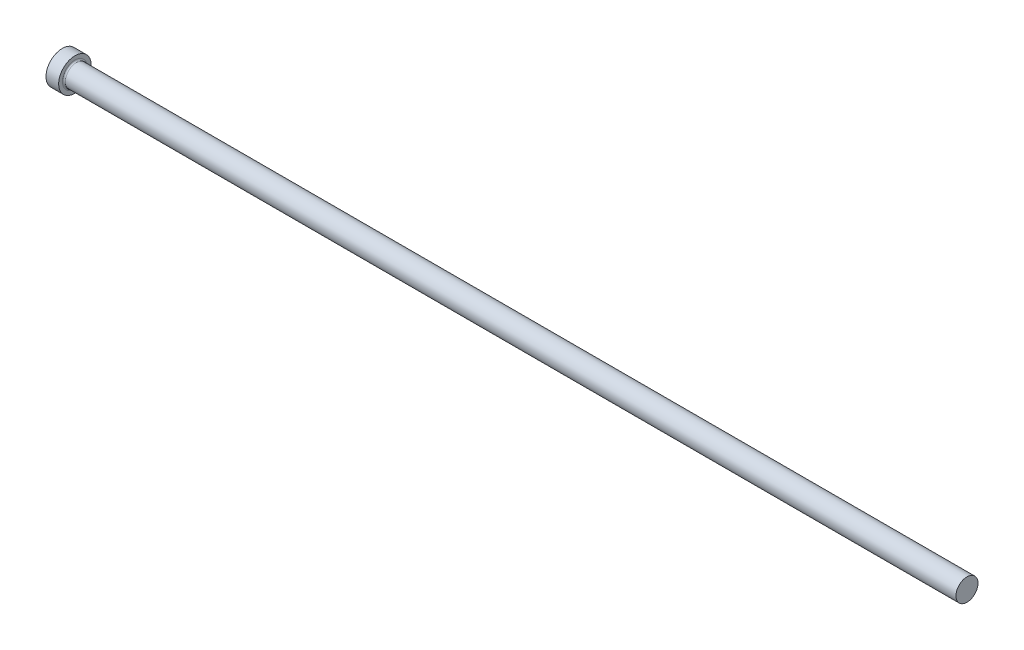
ISO-10303-21;
HEADER;
FILE_DESCRIPTION(('STEP AP214'),'2;1');
FILE_NAME('part.step','',(''),(''),'','','');
FILE_SCHEMA(('AUTOMOTIVE_DESIGN { 1 0 10303 214 1 1 1 1 }'));
ENDSEC;
DATA;
#1=APPLICATION_CONTEXT('core data for automotive mechanical design processes');
#2=APPLICATION_PROTOCOL_DEFINITION('international standard','automotive_design',2000,#1);
#3=PRODUCT_CONTEXT('',#1,'mechanical');
#4=PRODUCT('Part','Part','',(#3));
#5=PRODUCT_RELATED_PRODUCT_CATEGORY('part','',(#4));
#6=PRODUCT_DEFINITION_FORMATION('','',#4);
#7=PRODUCT_DEFINITION_CONTEXT('part definition',#1,'design');
#8=PRODUCT_DEFINITION('design','',#6,#7);
#9=PRODUCT_DEFINITION_SHAPE('','',#8);
#10=(LENGTH_UNIT() NAMED_UNIT(*) SI_UNIT(.MILLI.,.METRE.));
#11=(NAMED_UNIT(*) PLANE_ANGLE_UNIT() SI_UNIT($,.RADIAN.));
#12=(NAMED_UNIT(*) SI_UNIT($,.STERADIAN.) SOLID_ANGLE_UNIT());
#13=UNCERTAINTY_MEASURE_WITH_UNIT(LENGTH_MEASURE(1.E-05),#10,'distance_accuracy_value','');
#14=(GEOMETRIC_REPRESENTATION_CONTEXT(3) GLOBAL_UNCERTAINTY_ASSIGNED_CONTEXT((#13)) GLOBAL_UNIT_ASSIGNED_CONTEXT((#10,
#11,#12)) REPRESENTATION_CONTEXT('',''));
#15=CARTESIAN_POINT('',(0.,0.,0.));
#16=DIRECTION('',(0.,0.,1.));
#17=DIRECTION('',(1.,0.,0.));
#18=AXIS2_PLACEMENT_3D('',#15,#16,#17);
#19=CARTESIAN_POINT('',(0.,0.,0.));
#20=DIRECTION('',(-1.,0.,0.));
#21=DIRECTION('',(0.,-1.,0.));
#22=AXIS2_PLACEMENT_3D('',#19,#20,#21);
#23=PLANE('',#22);
#24=CARTESIAN_POINT('',(0.,0.,0.));
#25=DIRECTION('',(1.,0.,0.));
#26=DIRECTION('',(0.,1.,0.));
#27=AXIS2_PLACEMENT_3D('',#24,#25,#26);
#28=CIRCLE('',#27,9.);
#29=CARTESIAN_POINT('',(0.,9.,0.));
#30=VERTEX_POINT('',#29);
#31=EDGE_CURVE('E29',#30,#30,#28,.T.);
#32=ORIENTED_EDGE('',*,*,#31,.F.);
#33=EDGE_LOOP('',(#32));
#34=FACE_BOUND('',#33,.T.);
#35=ADVANCED_FACE('F14',(#34),#23,.T.);
#36=CARTESIAN_POINT('',(500.,0.,0.));
#37=DIRECTION('',(1.,0.,0.));
#38=DIRECTION('',(0.,1.,0.));
#39=AXIS2_PLACEMENT_3D('',#36,#37,#38);
#40=CYLINDRICAL_SURFACE('',#39,9.);
#41=ORIENTED_EDGE('',*,*,#31,.T.);
#42=EDGE_LOOP('',(#41));
#43=FACE_BOUND('',#42,.T.);
#44=CARTESIAN_POINT('',(7.,0.,0.));
#45=DIRECTION('',(1.,0.,0.));
#46=DIRECTION('',(0.,1.,0.));
#47=AXIS2_PLACEMENT_3D('',#44,#45,#46);
#48=CIRCLE('',#47,9.);
#49=CARTESIAN_POINT('',(7.,9.,0.));
#50=VERTEX_POINT('',#49);
#51=EDGE_CURVE('E34',#50,#50,#48,.T.);
#52=ORIENTED_EDGE('',*,*,#51,.F.);
#53=EDGE_LOOP('',(#52));
#54=FACE_BOUND('',#53,.T.);
#55=ADVANCED_FACE('F55',(#43,#54),#40,.T.);
#56=CARTESIAN_POINT('',(7.,9.,0.));
#57=DIRECTION('',(1.,0.,0.));
#58=DIRECTION('',(0.,1.,0.));
#59=AXIS2_PLACEMENT_3D('',#56,#57,#58);
#60=PLANE('',#59);
#61=CARTESIAN_POINT('',(7.,0.,0.));
#62=DIRECTION('',(1.,0.,0.));
#63=DIRECTION('',(0.,1.,0.));
#64=AXIS2_PLACEMENT_3D('',#61,#62,#63);
#65=CIRCLE('',#64,6.9);
#66=CARTESIAN_POINT('',(7.,6.9,0.));
#67=VERTEX_POINT('',#66);
#68=EDGE_CURVE('E9',#67,#67,#65,.F.);
#69=ORIENTED_EDGE('',*,*,#68,.T.);
#70=EDGE_LOOP('',(#69));
#71=FACE_BOUND('',#70,.T.);
#72=ORIENTED_EDGE('',*,*,#51,.T.);
#73=EDGE_LOOP('',(#72));
#74=FACE_BOUND('',#73,.T.);
#75=ADVANCED_FACE('F48',(#71,#74),#60,.T.);
#76=CARTESIAN_POINT('',(500.,0.,0.));
#77=DIRECTION('',(1.,0.,0.));
#78=DIRECTION('',(0.,1.,0.));
#79=AXIS2_PLACEMENT_3D('',#76,#77,#78);
#80=CYLINDRICAL_SURFACE('',#79,6.09999999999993);
#81=CARTESIAN_POINT('',(7.8,0.,0.));
#82=DIRECTION('',(1.,0.,0.));
#83=DIRECTION('',(0.,1.,0.));
#84=AXIS2_PLACEMENT_3D('',#81,#82,#83);
#85=CIRCLE('',#84,6.09999999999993);
#86=CARTESIAN_POINT('',(7.8,6.09999999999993,0.));
#87=VERTEX_POINT('',#86);
#88=EDGE_CURVE('E22',#87,#87,#85,.T.);
#89=ORIENTED_EDGE('',*,*,#88,.T.);
#90=EDGE_LOOP('',(#89));
#91=FACE_BOUND('',#90,.T.);
#92=CARTESIAN_POINT('',(500.,0.,0.));
#93=DIRECTION('',(1.,0.,0.));
#94=DIRECTION('',(0.,1.,0.));
#95=AXIS2_PLACEMENT_3D('',#92,#93,#94);
#96=CIRCLE('',#95,6.1);
#97=CARTESIAN_POINT('',(500.,6.10000000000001,0.));
#98=VERTEX_POINT('',#97);
#99=EDGE_CURVE('E39',#98,#98,#96,.T.);
#100=ORIENTED_EDGE('',*,*,#99,.F.);
#101=EDGE_LOOP('',(#100));
#102=FACE_BOUND('',#101,.T.);
#103=ADVANCED_FACE('F46',(#91,#102),#80,.T.);
#104=CARTESIAN_POINT('',(500.,6.1,0.));
#105=DIRECTION('',(1.,0.,0.));
#106=DIRECTION('',(0.,1.,0.));
#107=AXIS2_PLACEMENT_3D('',#104,#105,#106);
#108=PLANE('',#107);
#109=ORIENTED_EDGE('',*,*,#99,.T.);
#110=EDGE_LOOP('',(#109));
#111=FACE_BOUND('',#110,.T.);
#112=ADVANCED_FACE('F44',(#111),#108,.T.);
#113=CARTESIAN_POINT('',(7.8,0.,0.));
#114=DIRECTION('',(1.,0.,0.));
#115=DIRECTION('',(0.,1.,0.));
#116=AXIS2_PLACEMENT_3D('',#113,#114,#115);
#117=TOROIDAL_SURFACE('',#116,6.9,0.8);
#118=ORIENTED_EDGE('',*,*,#68,.F.);
#119=EDGE_LOOP('',(#118));
#120=FACE_BOUND('',#119,.T.);
#121=ORIENTED_EDGE('',*,*,#88,.F.);
#122=EDGE_LOOP('',(#121));
#123=FACE_BOUND('',#122,.T.);
#124=ADVANCED_FACE('F16',(#120,#123),#117,.F.);
#125=CLOSED_SHELL('',(#35,#55,#75,#103,#112,#124));
#126=MANIFOLD_SOLID_BREP('B1',#125);
#127=ADVANCED_BREP_SHAPE_REPRESENTATION('',(#18,#126),#14);
#128=SHAPE_DEFINITION_REPRESENTATION(#9,#127);
ENDSEC;
END-ISO-10303-21;
